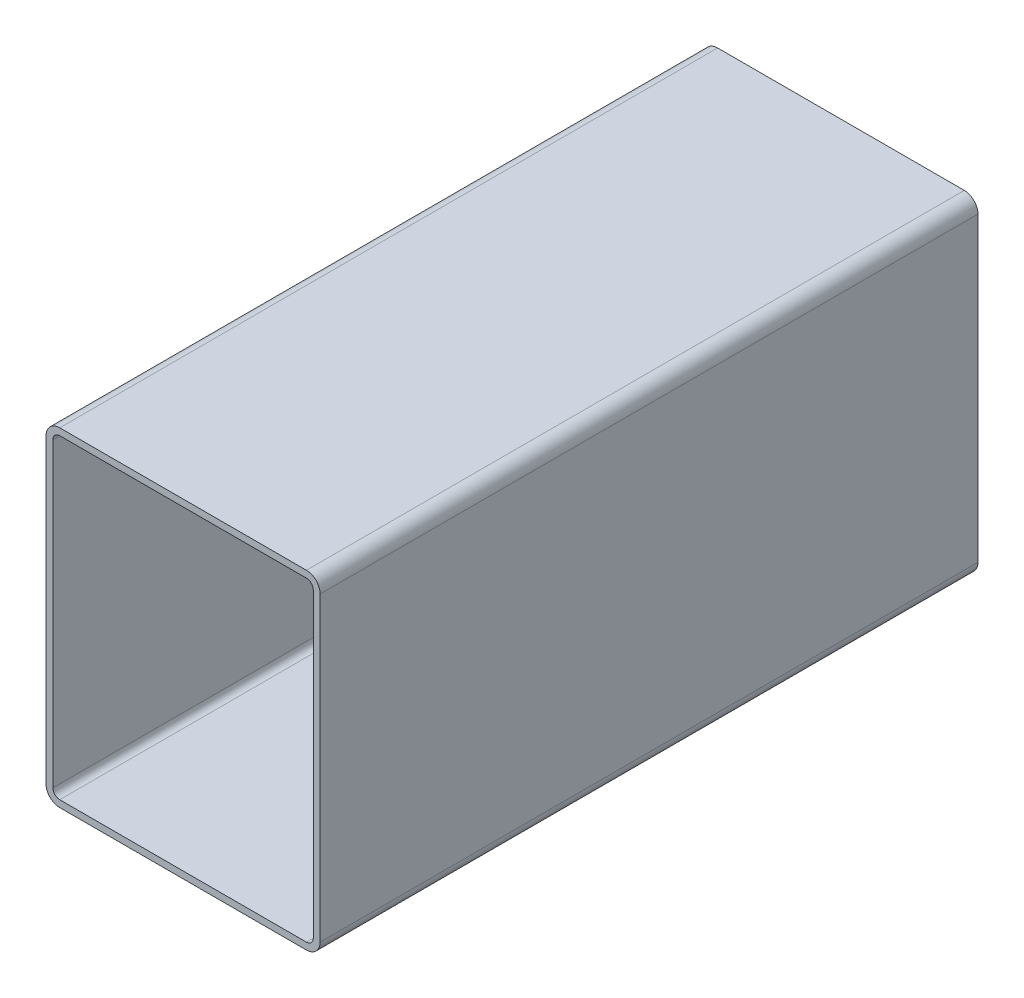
ISO-10303-21;
HEADER;
FILE_DESCRIPTION(('STEP AP214'),'2;1');
FILE_NAME('part.step','',(''),(''),'','','');
FILE_SCHEMA(('AUTOMOTIVE_DESIGN { 1 0 10303 214 1 1 1 1 }'));
ENDSEC;
DATA;
#1=APPLICATION_CONTEXT('core data for automotive mechanical design processes');
#2=APPLICATION_PROTOCOL_DEFINITION('international standard','automotive_design',2000,#1);
#3=PRODUCT_CONTEXT('',#1,'mechanical');
#4=PRODUCT('Part','Part','',(#3));
#5=PRODUCT_RELATED_PRODUCT_CATEGORY('part','',(#4));
#6=PRODUCT_DEFINITION_FORMATION('','',#4);
#7=PRODUCT_DEFINITION_CONTEXT('part definition',#1,'design');
#8=PRODUCT_DEFINITION('design','',#6,#7);
#9=PRODUCT_DEFINITION_SHAPE('','',#8);
#10=(LENGTH_UNIT() NAMED_UNIT(*) SI_UNIT(.MILLI.,.METRE.));
#11=(NAMED_UNIT(*) PLANE_ANGLE_UNIT() SI_UNIT($,.RADIAN.));
#12=(NAMED_UNIT(*) SI_UNIT($,.STERADIAN.) SOLID_ANGLE_UNIT());
#13=UNCERTAINTY_MEASURE_WITH_UNIT(LENGTH_MEASURE(1.E-05),#10,'distance_accuracy_value','');
#14=(GEOMETRIC_REPRESENTATION_CONTEXT(3) GLOBAL_UNCERTAINTY_ASSIGNED_CONTEXT((#13)) GLOBAL_UNIT_ASSIGNED_CONTEXT((#10,
#11,#12)) REPRESENTATION_CONTEXT('',''));
#15=CARTESIAN_POINT('',(0.,0.,0.));
#16=DIRECTION('',(0.,0.,1.));
#17=DIRECTION('',(1.,0.,0.));
#18=AXIS2_PLACEMENT_3D('',#15,#16,#17);
#19=CARTESIAN_POINT('',(7.2112396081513,148.061948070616,304.8));
#20=DIRECTION('',(0.,0.,1.));
#21=DIRECTION('',(1.,0.,0.));
#22=AXIS2_PLACEMENT_3D('',#19,#20,#21);
#23=PLANE('',#22);
#24=CARTESIAN_POINT('',(7.2112396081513,148.061948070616,304.8));
#25=DIRECTION('',(0.,0.,1.));
#26=DIRECTION('',(1.,0.,0.));
#27=AXIS2_PLACEMENT_3D('',#24,#25,#26);
#28=CIRCLE('',#27,6.35);
#29=CARTESIAN_POINT('',(7.2112396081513,154.411948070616,304.8));
#30=VERTEX_POINT('',#29);
#31=CARTESIAN_POINT('',(0.8612396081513,148.061948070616,304.8));
#32=VERTEX_POINT('',#31);
#33=EDGE_CURVE('E211',#30,#32,#28,.T.);
#34=ORIENTED_EDGE('',*,*,#33,.T.);
#35=DIRECTION('',(0.,-1.,0.));
#36=VECTOR('',#35,1.);
#37=CARTESIAN_POINT('',(0.8612396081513,8.36194807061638,304.8));
#38=LINE('',#37,#36);
#39=CARTESIAN_POINT('',(0.8612396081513,8.36194807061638,304.8));
#40=VERTEX_POINT('',#39);
#41=EDGE_CURVE('E214',#32,#40,#38,.T.);
#42=ORIENTED_EDGE('',*,*,#41,.T.);
#43=CARTESIAN_POINT('',(7.2112396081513,8.36194807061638,304.8));
#44=DIRECTION('',(0.,0.,1.));
#45=DIRECTION('',(1.,0.,0.));
#46=AXIS2_PLACEMENT_3D('',#43,#44,#45);
#47=CIRCLE('',#46,6.35);
#48=CARTESIAN_POINT('',(7.2112396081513,2.01194807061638,304.8));
#49=VERTEX_POINT('',#48);
#50=EDGE_CURVE('E217',#40,#49,#47,.T.);
#51=ORIENTED_EDGE('',*,*,#50,.T.);
#52=DIRECTION('',(1.,0.,0.));
#53=VECTOR('',#52,1.);
#54=CARTESIAN_POINT('',(121.511239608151,2.01194807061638,304.8));
#55=LINE('',#54,#53);
#56=CARTESIAN_POINT('',(121.511239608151,2.01194807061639,304.8));
#57=VERTEX_POINT('',#56);
#58=EDGE_CURVE('E219',#49,#57,#55,.T.);
#59=ORIENTED_EDGE('',*,*,#58,.T.);
#60=CARTESIAN_POINT('',(121.511239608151,8.36194807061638,304.8));
#61=DIRECTION('',(0.,0.,1.));
#62=DIRECTION('',(1.,0.,0.));
#63=AXIS2_PLACEMENT_3D('',#60,#61,#62);
#64=CIRCLE('',#63,6.35);
#65=CARTESIAN_POINT('',(127.861239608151,8.36194807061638,304.8));
#66=VERTEX_POINT('',#65);
#67=EDGE_CURVE('E221',#57,#66,#64,.T.);
#68=ORIENTED_EDGE('',*,*,#67,.T.);
#69=DIRECTION('',(0.,1.,0.));
#70=VECTOR('',#69,1.);
#71=CARTESIAN_POINT('',(127.861239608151,148.061948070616,304.8));
#72=LINE('',#71,#70);
#73=CARTESIAN_POINT('',(127.861239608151,148.061948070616,304.8));
#74=VERTEX_POINT('',#73);
#75=EDGE_CURVE('E223',#66,#74,#72,.T.);
#76=ORIENTED_EDGE('',*,*,#75,.T.);
#77=CARTESIAN_POINT('',(121.511239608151,148.061948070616,304.8));
#78=DIRECTION('',(0.,0.,1.));
#79=DIRECTION('',(1.,0.,0.));
#80=AXIS2_PLACEMENT_3D('',#77,#78,#79);
#81=CIRCLE('',#80,6.34999999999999);
#82=CARTESIAN_POINT('',(121.511239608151,154.411948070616,304.8));
#83=VERTEX_POINT('',#82);
#84=EDGE_CURVE('E225',#74,#83,#81,.T.);
#85=ORIENTED_EDGE('',*,*,#84,.T.);
#86=DIRECTION('',(-1.,0.,0.));
#87=VECTOR('',#86,1.);
#88=CARTESIAN_POINT('',(7.2112396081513,154.411948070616,304.8));
#89=LINE('',#88,#87);
#90=EDGE_CURVE('E227',#83,#30,#89,.T.);
#91=ORIENTED_EDGE('',*,*,#90,.T.);
#92=EDGE_LOOP('',(#34,#42,#51,#59,#68,#76,#85,#91));
#93=FACE_BOUND('',#92,.T.);
#94=DIRECTION('',(0.,-1.,0.));
#95=VECTOR('',#94,1.);
#96=CARTESIAN_POINT('',(4.0362396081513,8.36194807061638,304.8));
#97=LINE('',#96,#95);
#98=CARTESIAN_POINT('',(4.0362396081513,148.061948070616,304.8));
#99=VERTEX_POINT('',#98);
#100=CARTESIAN_POINT('',(4.0362396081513,8.36194807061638,304.8));
#101=VERTEX_POINT('',#100);
#102=EDGE_CURVE('E154',#99,#101,#97,.T.);
#103=ORIENTED_EDGE('',*,*,#102,.F.);
#104=CARTESIAN_POINT('',(7.2112396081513,148.061948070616,304.8));
#105=DIRECTION('',(0.,0.,1.));
#106=DIRECTION('',(1.,0.,0.));
#107=AXIS2_PLACEMENT_3D('',#104,#105,#106);
#108=CIRCLE('',#107,3.17500000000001);
#109=CARTESIAN_POINT('',(7.2112396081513,151.236948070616,304.8));
#110=VERTEX_POINT('',#109);
#111=EDGE_CURVE('E146',#110,#99,#108,.T.);
#112=ORIENTED_EDGE('',*,*,#111,.F.);
#113=DIRECTION('',(-1.,0.,0.));
#114=VECTOR('',#113,1.);
#115=CARTESIAN_POINT('',(7.2112396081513,151.236948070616,304.8));
#116=LINE('',#115,#114);
#117=CARTESIAN_POINT('',(121.511239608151,151.236948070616,304.8));
#118=VERTEX_POINT('',#117);
#119=EDGE_CURVE('E179',#118,#110,#116,.T.);
#120=ORIENTED_EDGE('',*,*,#119,.F.);
#121=CARTESIAN_POINT('',(121.511239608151,148.061948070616,304.8));
#122=DIRECTION('',(0.,0.,1.));
#123=DIRECTION('',(1.,0.,0.));
#124=AXIS2_PLACEMENT_3D('',#121,#122,#123);
#125=CIRCLE('',#124,3.175);
#126=CARTESIAN_POINT('',(124.686239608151,148.061948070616,304.8));
#127=VERTEX_POINT('',#126);
#128=EDGE_CURVE('E177',#127,#118,#125,.T.);
#129=ORIENTED_EDGE('',*,*,#128,.F.);
#130=DIRECTION('',(0.,1.,0.));
#131=VECTOR('',#130,1.);
#132=CARTESIAN_POINT('',(124.686239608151,148.061948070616,304.8));
#133=LINE('',#132,#131);
#134=CARTESIAN_POINT('',(124.686239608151,8.36194807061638,304.8));
#135=VERTEX_POINT('',#134);
#136=EDGE_CURVE('E175',#135,#127,#133,.T.);
#137=ORIENTED_EDGE('',*,*,#136,.F.);
#138=CARTESIAN_POINT('',(121.511239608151,8.36194807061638,304.8));
#139=DIRECTION('',(0.,0.,1.));
#140=DIRECTION('',(1.,0.,0.));
#141=AXIS2_PLACEMENT_3D('',#138,#139,#140);
#142=CIRCLE('',#141,3.175);
#143=CARTESIAN_POINT('',(121.511239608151,5.18694807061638,304.8));
#144=VERTEX_POINT('',#143);
#145=EDGE_CURVE('E173',#144,#135,#142,.T.);
#146=ORIENTED_EDGE('',*,*,#145,.F.);
#147=DIRECTION('',(1.,0.,0.));
#148=VECTOR('',#147,1.);
#149=CARTESIAN_POINT('',(121.511239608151,5.18694807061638,304.8));
#150=LINE('',#149,#148);
#151=CARTESIAN_POINT('',(7.2112396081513,5.18694807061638,304.8));
#152=VERTEX_POINT('',#151);
#153=EDGE_CURVE('E169',#152,#144,#150,.T.);
#154=ORIENTED_EDGE('',*,*,#153,.F.);
#155=CARTESIAN_POINT('',(7.2112396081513,8.36194807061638,304.8));
#156=DIRECTION('',(0.,0.,1.));
#157=DIRECTION('',(1.,0.,0.));
#158=AXIS2_PLACEMENT_3D('',#155,#156,#157);
#159=CIRCLE('',#158,3.175);
#160=EDGE_CURVE('E167',#101,#152,#159,.T.);
#161=ORIENTED_EDGE('',*,*,#160,.F.);
#162=EDGE_LOOP('',(#103,#112,#120,#129,#137,#146,#154,#161));
#163=FACE_BOUND('',#162,.T.);
#164=ADVANCED_FACE('F33',(#93,#163),#23,.T.);
#165=CARTESIAN_POINT('',(7.2112396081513,148.061948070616,0.));
#166=DIRECTION('',(0.,0.,1.));
#167=DIRECTION('',(1.,0.,0.));
#168=AXIS2_PLACEMENT_3D('',#165,#166,#167);
#169=PLANE('',#168);
#170=CARTESIAN_POINT('',(7.2112396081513,148.061948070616,0.));
#171=DIRECTION('',(0.,0.,1.));
#172=DIRECTION('',(1.,0.,0.));
#173=AXIS2_PLACEMENT_3D('',#170,#171,#172);
#174=CIRCLE('',#173,6.35);
#175=CARTESIAN_POINT('',(7.2112396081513,154.411948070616,0.));
#176=VERTEX_POINT('',#175);
#177=CARTESIAN_POINT('',(0.8612396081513,148.061948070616,0.));
#178=VERTEX_POINT('',#177);
#179=EDGE_CURVE('E162',#176,#178,#174,.T.);
#180=ORIENTED_EDGE('',*,*,#179,.F.);
#181=DIRECTION('',(-1.,0.,0.));
#182=VECTOR('',#181,1.);
#183=CARTESIAN_POINT('',(7.2112396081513,154.411948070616,0.));
#184=LINE('',#183,#182);
#185=CARTESIAN_POINT('',(121.511239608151,154.411948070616,0.));
#186=VERTEX_POINT('',#185);
#187=EDGE_CURVE('E215',#186,#176,#184,.T.);
#188=ORIENTED_EDGE('',*,*,#187,.F.);
#189=CARTESIAN_POINT('',(121.511239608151,148.061948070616,0.));
#190=DIRECTION('',(0.,0.,1.));
#191=DIRECTION('',(1.,0.,0.));
#192=AXIS2_PLACEMENT_3D('',#189,#190,#191);
#193=CIRCLE('',#192,6.34999999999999);
#194=CARTESIAN_POINT('',(127.861239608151,148.061948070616,0.));
#195=VERTEX_POINT('',#194);
#196=EDGE_CURVE('E242',#195,#186,#193,.T.);
#197=ORIENTED_EDGE('',*,*,#196,.F.);
#198=DIRECTION('',(0.,1.,0.));
#199=VECTOR('',#198,1.);
#200=CARTESIAN_POINT('',(127.861239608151,148.061948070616,0.));
#201=LINE('',#200,#199);
#202=CARTESIAN_POINT('',(127.861239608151,8.36194807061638,0.));
#203=VERTEX_POINT('',#202);
#204=EDGE_CURVE('E240',#203,#195,#201,.T.);
#205=ORIENTED_EDGE('',*,*,#204,.F.);
#206=CARTESIAN_POINT('',(121.511239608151,8.36194807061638,0.));
#207=DIRECTION('',(0.,0.,1.));
#208=DIRECTION('',(1.,0.,0.));
#209=AXIS2_PLACEMENT_3D('',#206,#207,#208);
#210=CIRCLE('',#209,6.35);
#211=CARTESIAN_POINT('',(121.511239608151,2.01194807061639,0.));
#212=VERTEX_POINT('',#211);
#213=EDGE_CURVE('E238',#212,#203,#210,.T.);
#214=ORIENTED_EDGE('',*,*,#213,.F.);
#215=DIRECTION('',(1.,0.,0.));
#216=VECTOR('',#215,1.);
#217=CARTESIAN_POINT('',(121.511239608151,2.01194807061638,0.));
#218=LINE('',#217,#216);
#219=CARTESIAN_POINT('',(7.2112396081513,2.01194807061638,0.));
#220=VERTEX_POINT('',#219);
#221=EDGE_CURVE('E236',#220,#212,#218,.T.);
#222=ORIENTED_EDGE('',*,*,#221,.F.);
#223=CARTESIAN_POINT('',(7.2112396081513,8.36194807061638,0.));
#224=DIRECTION('',(0.,0.,1.));
#225=DIRECTION('',(1.,0.,0.));
#226=AXIS2_PLACEMENT_3D('',#223,#224,#225);
#227=CIRCLE('',#226,6.35);
#228=CARTESIAN_POINT('',(0.8612396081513,8.36194807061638,0.));
#229=VERTEX_POINT('',#228);
#230=EDGE_CURVE('E234',#229,#220,#227,.T.);
#231=ORIENTED_EDGE('',*,*,#230,.F.);
#232=DIRECTION('',(0.,-1.,0.));
#233=VECTOR('',#232,1.);
#234=CARTESIAN_POINT('',(0.8612396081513,8.36194807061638,0.));
#235=LINE('',#234,#233);
#236=EDGE_CURVE('E232',#178,#229,#235,.T.);
#237=ORIENTED_EDGE('',*,*,#236,.F.);
#238=EDGE_LOOP('',(#180,#188,#197,#205,#214,#222,#231,#237));
#239=FACE_BOUND('',#238,.T.);
#240=CARTESIAN_POINT('',(7.2112396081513,148.061948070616,0.));
#241=DIRECTION('',(0.,0.,1.));
#242=DIRECTION('',(1.,0.,0.));
#243=AXIS2_PLACEMENT_3D('',#240,#241,#242);
#244=CIRCLE('',#243,3.17500000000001);
#245=CARTESIAN_POINT('',(7.2112396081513,151.236948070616,0.));
#246=VERTEX_POINT('',#245);
#247=CARTESIAN_POINT('',(4.0362396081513,148.061948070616,0.));
#248=VERTEX_POINT('',#247);
#249=EDGE_CURVE('E56',#246,#248,#244,.T.);
#250=ORIENTED_EDGE('',*,*,#249,.T.);
#251=DIRECTION('',(0.,-1.,0.));
#252=VECTOR('',#251,1.);
#253=CARTESIAN_POINT('',(4.0362396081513,8.36194807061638,0.));
#254=LINE('',#253,#252);
#255=CARTESIAN_POINT('',(4.0362396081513,8.36194807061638,0.));
#256=VERTEX_POINT('',#255);
#257=EDGE_CURVE('E161',#248,#256,#254,.T.);
#258=ORIENTED_EDGE('',*,*,#257,.T.);
#259=CARTESIAN_POINT('',(7.2112396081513,8.36194807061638,0.));
#260=DIRECTION('',(0.,0.,1.));
#261=DIRECTION('',(1.,0.,0.));
#262=AXIS2_PLACEMENT_3D('',#259,#260,#261);
#263=CIRCLE('',#262,3.175);
#264=CARTESIAN_POINT('',(7.2112396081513,5.18694807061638,0.));
#265=VERTEX_POINT('',#264);
#266=EDGE_CURVE('E183',#256,#265,#263,.T.);
#267=ORIENTED_EDGE('',*,*,#266,.T.);
#268=DIRECTION('',(1.,0.,0.));
#269=VECTOR('',#268,1.);
#270=CARTESIAN_POINT('',(121.511239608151,5.18694807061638,0.));
#271=LINE('',#270,#269);
#272=CARTESIAN_POINT('',(121.511239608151,5.18694807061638,0.));
#273=VERTEX_POINT('',#272);
#274=EDGE_CURVE('E186',#265,#273,#271,.T.);
#275=ORIENTED_EDGE('',*,*,#274,.T.);
#276=CARTESIAN_POINT('',(121.511239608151,8.36194807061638,0.));
#277=DIRECTION('',(0.,0.,1.));
#278=DIRECTION('',(1.,0.,0.));
#279=AXIS2_PLACEMENT_3D('',#276,#277,#278);
#280=CIRCLE('',#279,3.175);
#281=CARTESIAN_POINT('',(124.686239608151,8.36194807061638,0.));
#282=VERTEX_POINT('',#281);
#283=EDGE_CURVE('E189',#273,#282,#280,.T.);
#284=ORIENTED_EDGE('',*,*,#283,.T.);
#285=DIRECTION('',(0.,1.,0.));
#286=VECTOR('',#285,1.);
#287=CARTESIAN_POINT('',(124.686239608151,148.061948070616,0.));
#288=LINE('',#287,#286);
#289=CARTESIAN_POINT('',(124.686239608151,148.061948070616,0.));
#290=VERTEX_POINT('',#289);
#291=EDGE_CURVE('E192',#282,#290,#288,.T.);
#292=ORIENTED_EDGE('',*,*,#291,.T.);
#293=CARTESIAN_POINT('',(121.511239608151,148.061948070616,0.));
#294=DIRECTION('',(0.,0.,1.));
#295=DIRECTION('',(1.,0.,0.));
#296=AXIS2_PLACEMENT_3D('',#293,#294,#295);
#297=CIRCLE('',#296,3.175);
#298=CARTESIAN_POINT('',(121.511239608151,151.236948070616,0.));
#299=VERTEX_POINT('',#298);
#300=EDGE_CURVE('E195',#290,#299,#297,.T.);
#301=ORIENTED_EDGE('',*,*,#300,.T.);
#302=DIRECTION('',(-1.,0.,0.));
#303=VECTOR('',#302,1.);
#304=CARTESIAN_POINT('',(7.2112396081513,151.236948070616,0.));
#305=LINE('',#304,#303);
#306=EDGE_CURVE('E155',#299,#246,#305,.T.);
#307=ORIENTED_EDGE('',*,*,#306,.T.);
#308=EDGE_LOOP('',(#250,#258,#267,#275,#284,#292,#301,#307));
#309=FACE_BOUND('',#308,.T.);
#310=ADVANCED_FACE('F272',(#239,#309),#169,.F.);
#311=CARTESIAN_POINT('',(7.2112396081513,148.061948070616,304.8));
#312=DIRECTION('',(0.,0.,-1.));
#313=DIRECTION('',(-1.,0.,0.));
#314=AXIS2_PLACEMENT_3D('',#311,#312,#313);
#315=CYLINDRICAL_SURFACE('',#314,6.35);
#316=ORIENTED_EDGE('',*,*,#179,.T.);
#317=DIRECTION('',(0.,0.,-1.));
#318=VECTOR('',#317,1.);
#319=CARTESIAN_POINT('',(0.8612396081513,148.061948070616,304.8));
#320=LINE('',#319,#318);
#321=EDGE_CURVE('E11',#32,#178,#320,.T.);
#322=ORIENTED_EDGE('',*,*,#321,.F.);
#323=ORIENTED_EDGE('',*,*,#33,.F.);
#324=DIRECTION('',(0.,0.,-1.));
#325=VECTOR('',#324,1.);
#326=CARTESIAN_POINT('',(7.2112396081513,154.411948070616,304.8));
#327=LINE('',#326,#325);
#328=EDGE_CURVE('E229',#30,#176,#327,.T.);
#329=ORIENTED_EDGE('',*,*,#328,.T.);
#330=EDGE_LOOP('',(#316,#322,#323,#329));
#331=FACE_BOUND('',#330,.T.);
#332=ADVANCED_FACE('F35',(#331),#315,.T.);
#333=CARTESIAN_POINT('',(0.8612396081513,8.36194807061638,304.8));
#334=DIRECTION('',(1.,0.,0.));
#335=DIRECTION('',(0.,0.,-1.));
#336=AXIS2_PLACEMENT_3D('',#333,#334,#335);
#337=PLANE('',#336);
#338=ORIENTED_EDGE('',*,*,#236,.T.);
#339=DIRECTION('',(0.,0.,-1.));
#340=VECTOR('',#339,1.);
#341=CARTESIAN_POINT('',(0.8612396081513,8.36194807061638,304.8));
#342=LINE('',#341,#340);
#343=EDGE_CURVE('E41',#40,#229,#342,.T.);
#344=ORIENTED_EDGE('',*,*,#343,.F.);
#345=ORIENTED_EDGE('',*,*,#41,.F.);
#346=ORIENTED_EDGE('',*,*,#321,.T.);
#347=EDGE_LOOP('',(#338,#344,#345,#346));
#348=FACE_BOUND('',#347,.T.);
#349=ADVANCED_FACE('F289',(#348),#337,.F.);
#350=CARTESIAN_POINT('',(7.2112396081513,8.36194807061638,304.8));
#351=DIRECTION('',(0.,0.,-1.));
#352=DIRECTION('',(-1.,0.,0.));
#353=AXIS2_PLACEMENT_3D('',#350,#351,#352);
#354=CYLINDRICAL_SURFACE('',#353,6.35);
#355=ORIENTED_EDGE('',*,*,#230,.T.);
#356=DIRECTION('',(0.,0.,-1.));
#357=VECTOR('',#356,1.);
#358=CARTESIAN_POINT('',(7.2112396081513,2.01194807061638,304.8));
#359=LINE('',#358,#357);
#360=EDGE_CURVE('E259',#49,#220,#359,.T.);
#361=ORIENTED_EDGE('',*,*,#360,.F.);
#362=ORIENTED_EDGE('',*,*,#50,.F.);
#363=ORIENTED_EDGE('',*,*,#343,.T.);
#364=EDGE_LOOP('',(#355,#361,#362,#363));
#365=FACE_BOUND('',#364,.T.);
#366=ADVANCED_FACE('F266',(#365),#354,.T.);
#367=CARTESIAN_POINT('',(121.511239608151,2.01194807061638,304.8));
#368=DIRECTION('',(0.,1.,0.));
#369=DIRECTION('',(0.,0.,1.));
#370=AXIS2_PLACEMENT_3D('',#367,#368,#369);
#371=PLANE('',#370);
#372=ORIENTED_EDGE('',*,*,#221,.T.);
#373=DIRECTION('',(0.,0.,-1.));
#374=VECTOR('',#373,1.);
#375=CARTESIAN_POINT('',(121.511239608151,2.01194807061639,304.8));
#376=LINE('',#375,#374);
#377=EDGE_CURVE('E256',#57,#212,#376,.T.);
#378=ORIENTED_EDGE('',*,*,#377,.F.);
#379=ORIENTED_EDGE('',*,*,#58,.F.);
#380=ORIENTED_EDGE('',*,*,#360,.T.);
#381=EDGE_LOOP('',(#372,#378,#379,#380));
#382=FACE_BOUND('',#381,.T.);
#383=ADVANCED_FACE('F278',(#382),#371,.F.);
#384=CARTESIAN_POINT('',(121.511239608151,8.36194807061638,304.8));
#385=DIRECTION('',(0.,0.,-1.));
#386=DIRECTION('',(-1.,0.,0.));
#387=AXIS2_PLACEMENT_3D('',#384,#385,#386);
#388=CYLINDRICAL_SURFACE('',#387,6.35);
#389=ORIENTED_EDGE('',*,*,#213,.T.);
#390=DIRECTION('',(0.,0.,-1.));
#391=VECTOR('',#390,1.);
#392=CARTESIAN_POINT('',(127.861239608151,8.36194807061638,304.8));
#393=LINE('',#392,#391);
#394=EDGE_CURVE('E253',#66,#203,#393,.T.);
#395=ORIENTED_EDGE('',*,*,#394,.F.);
#396=ORIENTED_EDGE('',*,*,#67,.F.);
#397=ORIENTED_EDGE('',*,*,#377,.T.);
#398=EDGE_LOOP('',(#389,#395,#396,#397));
#399=FACE_BOUND('',#398,.T.);
#400=ADVANCED_FACE('F282',(#399),#388,.T.);
#401=CARTESIAN_POINT('',(127.861239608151,148.061948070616,304.8));
#402=DIRECTION('',(-1.,0.,0.));
#403=DIRECTION('',(0.,0.,1.));
#404=AXIS2_PLACEMENT_3D('',#401,#402,#403);
#405=PLANE('',#404);
#406=ORIENTED_EDGE('',*,*,#204,.T.);
#407=DIRECTION('',(0.,0.,-1.));
#408=VECTOR('',#407,1.);
#409=CARTESIAN_POINT('',(127.861239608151,148.061948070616,304.8));
#410=LINE('',#409,#408);
#411=EDGE_CURVE('E250',#74,#195,#410,.T.);
#412=ORIENTED_EDGE('',*,*,#411,.F.);
#413=ORIENTED_EDGE('',*,*,#75,.F.);
#414=ORIENTED_EDGE('',*,*,#394,.T.);
#415=EDGE_LOOP('',(#406,#412,#413,#414));
#416=FACE_BOUND('',#415,.T.);
#417=ADVANCED_FACE('F302',(#416),#405,.F.);
#418=CARTESIAN_POINT('',(121.511239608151,148.061948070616,304.8));
#419=DIRECTION('',(0.,0.,-1.));
#420=DIRECTION('',(-1.,0.,0.));
#421=AXIS2_PLACEMENT_3D('',#418,#419,#420);
#422=CYLINDRICAL_SURFACE('',#421,6.34999999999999);
#423=ORIENTED_EDGE('',*,*,#196,.T.);
#424=DIRECTION('',(0.,0.,-1.));
#425=VECTOR('',#424,1.);
#426=CARTESIAN_POINT('',(121.511239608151,154.411948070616,304.8));
#427=LINE('',#426,#425);
#428=EDGE_CURVE('E247',#83,#186,#427,.T.);
#429=ORIENTED_EDGE('',*,*,#428,.F.);
#430=ORIENTED_EDGE('',*,*,#84,.F.);
#431=ORIENTED_EDGE('',*,*,#411,.T.);
#432=EDGE_LOOP('',(#423,#429,#430,#431));
#433=FACE_BOUND('',#432,.T.);
#434=ADVANCED_FACE('F300',(#433),#422,.T.);
#435=CARTESIAN_POINT('',(7.2112396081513,154.411948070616,304.8));
#436=DIRECTION('',(0.,-1.,0.));
#437=DIRECTION('',(0.,0.,-1.));
#438=AXIS2_PLACEMENT_3D('',#435,#436,#437);
#439=PLANE('',#438);
#440=ORIENTED_EDGE('',*,*,#187,.T.);
#441=ORIENTED_EDGE('',*,*,#328,.F.);
#442=ORIENTED_EDGE('',*,*,#90,.F.);
#443=ORIENTED_EDGE('',*,*,#428,.T.);
#444=EDGE_LOOP('',(#440,#441,#442,#443));
#445=FACE_BOUND('',#444,.T.);
#446=ADVANCED_FACE('F295',(#445),#439,.F.);
#447=CARTESIAN_POINT('',(7.2112396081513,148.061948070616,304.8));
#448=DIRECTION('',(0.,0.,-1.));
#449=DIRECTION('',(-1.,0.,0.));
#450=AXIS2_PLACEMENT_3D('',#447,#448,#449);
#451=CYLINDRICAL_SURFACE('',#450,3.17500000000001);
#452=ORIENTED_EDGE('',*,*,#249,.F.);
#453=DIRECTION('',(0.,0.,-1.));
#454=VECTOR('',#453,1.);
#455=CARTESIAN_POINT('',(7.2112396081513,151.236948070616,304.8));
#456=LINE('',#455,#454);
#457=EDGE_CURVE('E150',#110,#246,#456,.T.);
#458=ORIENTED_EDGE('',*,*,#457,.F.);
#459=ORIENTED_EDGE('',*,*,#111,.T.);
#460=DIRECTION('',(0.,0.,-1.));
#461=VECTOR('',#460,1.);
#462=CARTESIAN_POINT('',(4.0362396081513,148.061948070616,304.8));
#463=LINE('',#462,#461);
#464=EDGE_CURVE('E149',#99,#248,#463,.T.);
#465=ORIENTED_EDGE('',*,*,#464,.T.);
#466=EDGE_LOOP('',(#452,#458,#459,#465));
#467=FACE_BOUND('',#466,.T.);
#468=ADVANCED_FACE('F148',(#467),#451,.F.);
#469=CARTESIAN_POINT('',(4.0362396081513,8.36194807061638,304.8));
#470=DIRECTION('',(1.,0.,0.));
#471=DIRECTION('',(0.,0.,-1.));
#472=AXIS2_PLACEMENT_3D('',#469,#470,#471);
#473=PLANE('',#472);
#474=ORIENTED_EDGE('',*,*,#257,.F.);
#475=ORIENTED_EDGE('',*,*,#464,.F.);
#476=ORIENTED_EDGE('',*,*,#102,.T.);
#477=DIRECTION('',(0.,0.,-1.));
#478=VECTOR('',#477,1.);
#479=CARTESIAN_POINT('',(4.0362396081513,8.36194807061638,304.8));
#480=LINE('',#479,#478);
#481=EDGE_CURVE('E163',#101,#256,#480,.T.);
#482=ORIENTED_EDGE('',*,*,#481,.T.);
#483=EDGE_LOOP('',(#474,#475,#476,#482));
#484=FACE_BOUND('',#483,.T.);
#485=ADVANCED_FACE('F158',(#484),#473,.T.);
#486=CARTESIAN_POINT('',(7.2112396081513,8.36194807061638,304.8));
#487=DIRECTION('',(0.,0.,-1.));
#488=DIRECTION('',(-1.,0.,0.));
#489=AXIS2_PLACEMENT_3D('',#486,#487,#488);
#490=CYLINDRICAL_SURFACE('',#489,3.175);
#491=ORIENTED_EDGE('',*,*,#266,.F.);
#492=ORIENTED_EDGE('',*,*,#481,.F.);
#493=ORIENTED_EDGE('',*,*,#160,.T.);
#494=DIRECTION('',(0.,0.,-1.));
#495=VECTOR('',#494,1.);
#496=CARTESIAN_POINT('',(7.2112396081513,5.18694807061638,304.8));
#497=LINE('',#496,#495);
#498=EDGE_CURVE('E208',#152,#265,#497,.T.);
#499=ORIENTED_EDGE('',*,*,#498,.T.);
#500=EDGE_LOOP('',(#491,#492,#493,#499));
#501=FACE_BOUND('',#500,.T.);
#502=ADVANCED_FACE('F327',(#501),#490,.F.);
#503=CARTESIAN_POINT('',(121.511239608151,5.18694807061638,304.8));
#504=DIRECTION('',(0.,1.,0.));
#505=DIRECTION('',(0.,0.,1.));
#506=AXIS2_PLACEMENT_3D('',#503,#504,#505);
#507=PLANE('',#506);
#508=ORIENTED_EDGE('',*,*,#274,.F.);
#509=ORIENTED_EDGE('',*,*,#498,.F.);
#510=ORIENTED_EDGE('',*,*,#153,.T.);
#511=DIRECTION('',(0.,0.,-1.));
#512=VECTOR('',#511,1.);
#513=CARTESIAN_POINT('',(121.511239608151,5.18694807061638,304.8));
#514=LINE('',#513,#512);
#515=EDGE_CURVE('E206',#144,#273,#514,.T.);
#516=ORIENTED_EDGE('',*,*,#515,.T.);
#517=EDGE_LOOP('',(#508,#509,#510,#516));
#518=FACE_BOUND('',#517,.T.);
#519=ADVANCED_FACE('F331',(#518),#507,.T.);
#520=CARTESIAN_POINT('',(121.511239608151,8.36194807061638,304.8));
#521=DIRECTION('',(0.,0.,-1.));
#522=DIRECTION('',(-1.,0.,0.));
#523=AXIS2_PLACEMENT_3D('',#520,#521,#522);
#524=CYLINDRICAL_SURFACE('',#523,3.175);
#525=ORIENTED_EDGE('',*,*,#283,.F.);
#526=ORIENTED_EDGE('',*,*,#515,.F.);
#527=ORIENTED_EDGE('',*,*,#145,.T.);
#528=DIRECTION('',(0.,0.,-1.));
#529=VECTOR('',#528,1.);
#530=CARTESIAN_POINT('',(124.686239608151,8.36194807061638,304.8));
#531=LINE('',#530,#529);
#532=EDGE_CURVE('E204',#135,#282,#531,.T.);
#533=ORIENTED_EDGE('',*,*,#532,.T.);
#534=EDGE_LOOP('',(#525,#526,#527,#533));
#535=FACE_BOUND('',#534,.T.);
#536=ADVANCED_FACE('F337',(#535),#524,.F.);
#537=CARTESIAN_POINT('',(124.686239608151,148.061948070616,304.8));
#538=DIRECTION('',(-1.,0.,0.));
#539=DIRECTION('',(0.,0.,1.));
#540=AXIS2_PLACEMENT_3D('',#537,#538,#539);
#541=PLANE('',#540);
#542=ORIENTED_EDGE('',*,*,#291,.F.);
#543=ORIENTED_EDGE('',*,*,#532,.F.);
#544=ORIENTED_EDGE('',*,*,#136,.T.);
#545=DIRECTION('',(0.,0.,-1.));
#546=VECTOR('',#545,1.);
#547=CARTESIAN_POINT('',(124.686239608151,148.061948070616,304.8));
#548=LINE('',#547,#546);
#549=EDGE_CURVE('E202',#127,#290,#548,.T.);
#550=ORIENTED_EDGE('',*,*,#549,.T.);
#551=EDGE_LOOP('',(#542,#543,#544,#550));
#552=FACE_BOUND('',#551,.T.);
#553=ADVANCED_FACE('F341',(#552),#541,.T.);
#554=CARTESIAN_POINT('',(121.511239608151,148.061948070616,304.8));
#555=DIRECTION('',(0.,0.,-1.));
#556=DIRECTION('',(-1.,0.,0.));
#557=AXIS2_PLACEMENT_3D('',#554,#555,#556);
#558=CYLINDRICAL_SURFACE('',#557,3.175);
#559=ORIENTED_EDGE('',*,*,#300,.F.);
#560=ORIENTED_EDGE('',*,*,#549,.F.);
#561=ORIENTED_EDGE('',*,*,#128,.T.);
#562=DIRECTION('',(0.,0.,-1.));
#563=VECTOR('',#562,1.);
#564=CARTESIAN_POINT('',(121.511239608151,151.236948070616,304.8));
#565=LINE('',#564,#563);
#566=EDGE_CURVE('E48',#118,#299,#565,.T.);
#567=ORIENTED_EDGE('',*,*,#566,.T.);
#568=EDGE_LOOP('',(#559,#560,#561,#567));
#569=FACE_BOUND('',#568,.T.);
#570=ADVANCED_FACE('F345',(#569),#558,.F.);
#571=CARTESIAN_POINT('',(7.2112396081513,151.236948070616,304.8));
#572=DIRECTION('',(0.,-1.,0.));
#573=DIRECTION('',(0.,0.,-1.));
#574=AXIS2_PLACEMENT_3D('',#571,#572,#573);
#575=PLANE('',#574);
#576=ORIENTED_EDGE('',*,*,#306,.F.);
#577=ORIENTED_EDGE('',*,*,#566,.F.);
#578=ORIENTED_EDGE('',*,*,#119,.T.);
#579=ORIENTED_EDGE('',*,*,#457,.T.);
#580=EDGE_LOOP('',(#576,#577,#578,#579));
#581=FACE_BOUND('',#580,.T.);
#582=ADVANCED_FACE('F349',(#581),#575,.T.);
#583=CLOSED_SHELL('',(#164,#310,#332,#349,#366,#383,#400,#417,#434,#446,#468,#485,#502,#519,
#536,#553,#570,#582));
#584=MANIFOLD_SOLID_BREP('B2',#583);
#585=ADVANCED_BREP_SHAPE_REPRESENTATION('',(#18,#584),#14);
#586=SHAPE_DEFINITION_REPRESENTATION(#9,#585);
ENDSEC;
END-ISO-10303-21;
